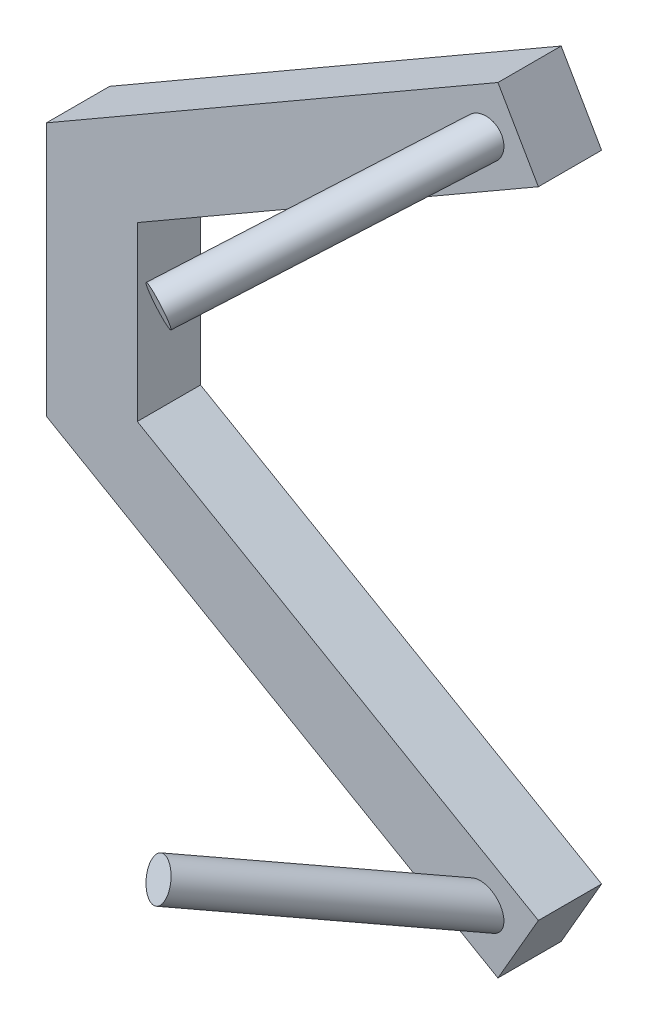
from build123d import *

# Parameters (mm, degrees)
LINEAR_AUSTRAGEN1_DEPTH             = 100
SKIZZE3_R                           = 30
LINEAR_AUSTRAGEN2_DEPTH             = 410.5
LINEAR_AUSTRAGEN2_DIRECTION_2_REACH = 875.831


with BuildPart() as part:
    # Skizze1 → Linear austragen1 (new body)
    with BuildSketch(Plane.XY):
        Polygon((0, 0), (143.761573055, 0), (143.761573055, -136.228327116), (778.072644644, -502.447995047), (714.102329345, -613.247831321), (0, -200.960659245), align=None)
    extrude(amount=-LINEAR_AUSTRAGEN1_DEPTH)

    # Skizze3 → Linear austragen2 (add)
    with BuildSketch(Plane(origin=(690.687568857, -525.862755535, 0), x_dir=(0.9217489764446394, 0.13653139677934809, 0.362957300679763), z_dir=(-0.3877870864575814, 0.32452776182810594, 0.8627299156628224))):
        with Locations(Location((0, 0, 0), (0, 0, 351.70071585))):
            Circle(SKIZZE3_R)
    extrude(amount=LINEAR_AUSTRAGEN2_DEPTH)

    # Linear austragen2 direction 2: up to this face of the body (flat: up to its plane)
    linear_austragen2_direction_2_end = Plane(part.part.faces().sort_by_distance((341.283682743, -309.530340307, 0))[0])
    # Skizze3 → Linear austragen2 direction 2 (add, up to the picked face)
    with BuildSketch(Plane(origin=(690.687568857, -525.862755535, 0), x_dir=(0.9217489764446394, 0.13653139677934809, 0.362957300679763), z_dir=(-0.3877870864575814, 0.32452776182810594, 0.8627299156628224)), mode=Mode.PRIVATE) as linear_austragen2_direction_2_sk1:
        with Locations(Location((0, 0, 0), (0, 0, 351.70071585))):
            Circle(SKIZZE3_R)
    linear_austragen2_direction_2_tool1 = split(extrude(linear_austragen2_direction_2_sk1.sketch, amount=-LINEAR_AUSTRAGEN2_DIRECTION_2_REACH, mode=Mode.PRIVATE), bisect_by=linear_austragen2_direction_2_end, keep=Keep.BOTH, mode=Mode.PRIVATE)
    add(linear_austragen2_direction_2_tool1.solids().sort_by(Axis((690.687569, -525.862756, 0), (0.3877870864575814, -0.32452776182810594, -0.8627299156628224)))[0])

    # Spiegeln1: part across plane


with BuildPart() as part_1:
    add(part.part)
    add(part.part.mirror(Plane.ZX))


solid = part_1.part
